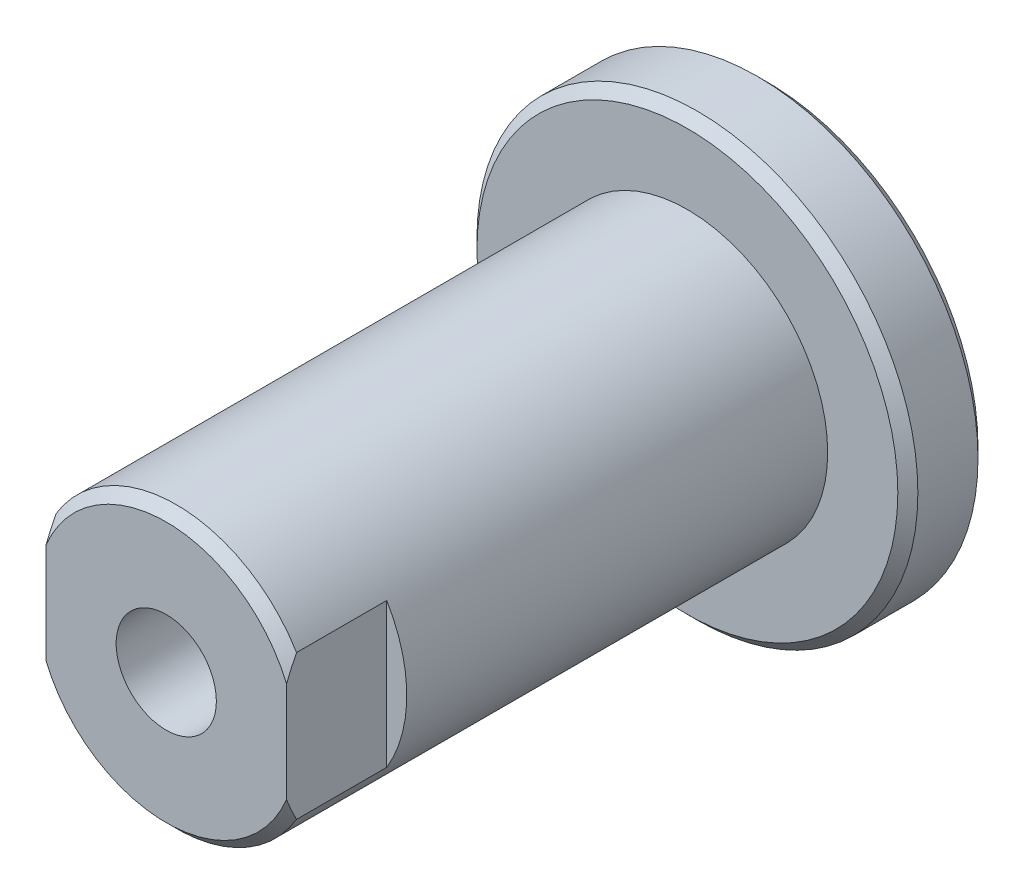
ISO-10303-21;
HEADER;
FILE_DESCRIPTION(('STEP AP214'),'2;1');
FILE_NAME('part.step','',(''),(''),'','','');
FILE_SCHEMA(('AUTOMOTIVE_DESIGN { 1 0 10303 214 1 1 1 1 }'));
ENDSEC;
DATA;
#1=APPLICATION_CONTEXT('core data for automotive mechanical design processes');
#2=APPLICATION_PROTOCOL_DEFINITION('international standard','automotive_design',2000,#1);
#3=PRODUCT_CONTEXT('',#1,'mechanical');
#4=PRODUCT('Part','Part','',(#3));
#5=PRODUCT_RELATED_PRODUCT_CATEGORY('part','',(#4));
#6=PRODUCT_DEFINITION_FORMATION('','',#4);
#7=PRODUCT_DEFINITION_CONTEXT('part definition',#1,'design');
#8=PRODUCT_DEFINITION('design','',#6,#7);
#9=PRODUCT_DEFINITION_SHAPE('','',#8);
#10=(LENGTH_UNIT() NAMED_UNIT(*) SI_UNIT(.MILLI.,.METRE.));
#11=(NAMED_UNIT(*) PLANE_ANGLE_UNIT() SI_UNIT($,.RADIAN.));
#12=(NAMED_UNIT(*) SI_UNIT($,.STERADIAN.) SOLID_ANGLE_UNIT());
#13=UNCERTAINTY_MEASURE_WITH_UNIT(LENGTH_MEASURE(1.E-05),#10,'distance_accuracy_value','');
#14=(GEOMETRIC_REPRESENTATION_CONTEXT(3) GLOBAL_UNCERTAINTY_ASSIGNED_CONTEXT((#13)) GLOBAL_UNIT_ASSIGNED_CONTEXT((#10,
#11,#12)) REPRESENTATION_CONTEXT('',''));
#15=CARTESIAN_POINT('',(0.,0.,0.));
#16=DIRECTION('',(0.,0.,1.));
#17=DIRECTION('',(1.,0.,0.));
#18=AXIS2_PLACEMENT_3D('',#15,#16,#17);
#19=CARTESIAN_POINT('',(0.,0.,30.));
#20=DIRECTION('',(0.,0.,-1.));
#21=DIRECTION('',(-1.,0.,0.));
#22=AXIS2_PLACEMENT_3D('',#19,#20,#21);
#23=CONICAL_SURFACE('',#22,6.5,0.785398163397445);
#24=CARTESIAN_POINT('',(-6.,-14.189120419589,21.0944445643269));
#25=CARTESIAN_POINT('',(-6.,-13.9783762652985,21.2885446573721));
#26=CARTESIAN_POINT('',(-6.,-13.7673091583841,21.4822940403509));
#27=CARTESIAN_POINT('',(-6.,-13.3444339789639,21.8689856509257));
#28=CARTESIAN_POINT('',(-6.,-13.1326259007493,22.0619278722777));
#29=CARTESIAN_POINT('',(-6.,-12.4958585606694,22.6394659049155));
#30=CARTESIAN_POINT('',(-6.,-12.0696493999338,23.0226870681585));
#31=CARTESIAN_POINT('',(-6.,-11.2102831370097,23.7865653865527));
#32=CARTESIAN_POINT('',(-6.,-10.7770995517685,24.1671928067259));
#33=CARTESIAN_POINT('',(-6.,-9.90489563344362,24.9216189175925));
#34=CARTESIAN_POINT('',(-6.,-9.46587600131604,25.2954184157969));
#35=CARTESIAN_POINT('',(-6.,-8.66228186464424,25.9645716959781));
#36=CARTESIAN_POINT('',(-6.,-8.29907851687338,26.2615642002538));
#37=CARTESIAN_POINT('',(-6.,-7.74886070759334,26.700373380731));
#38=CARTESIAN_POINT('',(-6.,-7.56452615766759,26.845549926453));
#39=CARTESIAN_POINT('',(-6.,-7.19377345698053,27.133214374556));
#40=CARTESIAN_POINT('',(-6.,-7.00735535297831,27.2757023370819));
#41=CARTESIAN_POINT('',(-6.,-6.63228473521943,27.5573006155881));
#42=CARTESIAN_POINT('',(-6.,-6.44363475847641,27.6964143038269));
#43=CARTESIAN_POINT('',(-6.,-6.0635049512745,27.9707110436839));
#44=CARTESIAN_POINT('',(-6.,-5.87202526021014,28.1058942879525));
#45=CARTESIAN_POINT('',(-6.,-5.48581052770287,28.3713809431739));
#46=CARTESIAN_POINT('',(-6.,-5.29107678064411,28.5016862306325));
#47=CARTESIAN_POINT('',(-6.,-4.89772697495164,28.756276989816));
#48=CARTESIAN_POINT('',(-6.,-4.69911136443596,28.8805631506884));
#49=CARTESIAN_POINT('',(-6.,-4.29915222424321,29.1204786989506));
#50=CARTESIAN_POINT('',(-6.,-4.09785008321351,29.2361766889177));
#51=CARTESIAN_POINT('',(-6.,-3.69005957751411,29.4581762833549));
#52=CARTESIAN_POINT('',(-6.,-3.48357065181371,29.5644768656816));
#53=CARTESIAN_POINT('',(-6.,-3.06498745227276,29.7649849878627));
#54=CARTESIAN_POINT('',(-6.,-2.8528986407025,29.859203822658));
#55=CARTESIAN_POINT('',(-6.,-2.42254844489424,30.0323888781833));
#56=CARTESIAN_POINT('',(-6.,-2.20428887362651,30.1113595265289));
#57=CARTESIAN_POINT('',(-6.,-1.80920727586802,30.2353361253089));
#58=CARTESIAN_POINT('',(-6.,-1.63353777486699,30.2839940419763));
#59=CARTESIAN_POINT('',(-6.,-1.27894637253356,30.3676229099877));
#60=CARTESIAN_POINT('',(-6.,-1.10002490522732,30.4025956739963));
#61=CARTESIAN_POINT('',(-6.,-0.740353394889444,30.4570998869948));
#62=CARTESIAN_POINT('',(-6.,-0.559610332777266,30.4766767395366));
#63=CARTESIAN_POINT('',(-6.,-0.197085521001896,30.4994890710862));
#64=CARTESIAN_POINT('',(-6.,-0.0153038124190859,30.5027251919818));
#65=CARTESIAN_POINT('',(-6.,0.348026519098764,30.4926630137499));
#66=CARTESIAN_POINT('',(-6.,0.529574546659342,30.4793435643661));
#67=CARTESIAN_POINT('',(-6.,0.890796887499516,30.4368881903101));
#68=CARTESIAN_POINT('',(-6.,1.07047104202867,30.4077509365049));
#69=CARTESIAN_POINT('',(-6.,1.42740071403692,30.3350322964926));
#70=CARTESIAN_POINT('',(-6.,1.60464720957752,30.2914072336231));
#71=CARTESIAN_POINT('',(-6.,1.9555280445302,30.1916103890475));
#72=CARTESIAN_POINT('',(-6.,2.12916232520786,30.1354384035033));
#73=CARTESIAN_POINT('',(-6.,2.50243151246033,30.0017905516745));
#74=CARTESIAN_POINT('',(-6.,2.70134325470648,29.9223089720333));
#75=CARTESIAN_POINT('',(-6.,3.09406710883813,29.7515219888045));
#76=CARTESIAN_POINT('',(-6.,3.28787684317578,29.6602111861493));
#77=CARTESIAN_POINT('',(-6.,3.67106823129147,29.467985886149));
#78=CARTESIAN_POINT('',(-6.,3.86044140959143,29.3670546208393));
#79=CARTESIAN_POINT('',(-6.,4.23490054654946,29.157636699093));
#80=CARTESIAN_POINT('',(-6.,4.41998710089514,29.0491511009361));
#81=CARTESIAN_POINT('',(-6.,4.78863644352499,28.8247540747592));
#82=CARTESIAN_POINT('',(-6.,4.97215428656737,28.7087691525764));
#83=CARTESIAN_POINT('',(-6.,5.33589527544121,28.4717527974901));
#84=CARTESIAN_POINT('',(-6.,5.51611833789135,28.3507212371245));
#85=CARTESIAN_POINT('',(-6.,5.87353199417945,28.1046683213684));
#86=CARTESIAN_POINT('',(-6.,6.05072558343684,27.9796513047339));
#87=CARTESIAN_POINT('',(-6.,6.4026678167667,27.7262165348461));
#88=CARTESIAN_POINT('',(-6.,6.57741636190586,27.5977986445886));
#89=CARTESIAN_POINT('',(-6.,7.0861535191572,27.2175520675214));
#90=CARTESIAN_POINT('',(-6.,7.41727857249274,26.9618924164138));
#91=CARTESIAN_POINT('',(-6.,8.0735777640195,26.4430411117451));
#92=CARTESIAN_POINT('',(-6.,8.39875139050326,26.1798488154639));
#93=CARTESIAN_POINT('',(-6.,9.04470289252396,25.6476667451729));
#94=CARTESIAN_POINT('',(-6.,9.3654774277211,25.3786729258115));
#95=CARTESIAN_POINT('',(-6.,10.0033851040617,24.836401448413));
#96=CARTESIAN_POINT('',(-6.,10.3205181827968,24.5631237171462));
#97=CARTESIAN_POINT('',(-6.,10.9366376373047,24.0264970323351));
#98=CARTESIAN_POINT('',(-6.,11.2357612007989,23.7633053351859));
#99=CARTESIAN_POINT('',(-6.,11.8318528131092,23.2344867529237));
#100=CARTESIAN_POINT('',(-6.,12.1288208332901,22.9688598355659));
#101=CARTESIAN_POINT('',(-6.,12.7205312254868,22.4360265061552));
#102=CARTESIAN_POINT('',(-6.,13.0152762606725,22.1688230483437));
#103=CARTESIAN_POINT('',(-6.,13.6032575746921,21.6327807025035));
#104=CARTESIAN_POINT('',(-6.,13.8964939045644,21.3639418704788));
#105=CARTESIAN_POINT('',(-6.,14.189120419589,21.0944445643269));
#106=B_SPLINE_CURVE_WITH_KNOTS('',3,(#24,#25,#26,#27,#28,#29,#30,#31,#32,#33,#34,#35,#36,#37,
#38,#39,#40,#41,#42,#43,#44,#45,#46,#47,#48,#49,#50,#51,#52,#53,#54,#55,#56,#57,#58,#59,#60,#61,
#62,#63,#64,#65,#66,#67,#68,#69,#70,#71,#72,#73,#74,#75,#76,#77,#78,#79,#80,#81,#82,#83,#84,#85,
#86,#87,#88,#89,#90,#91,#92,#93,#94,#95,#96,#97,#98,#99,#100,#101,#102,#103,#104,#105),
.UNSPECIFIED.,.F.,.F.,(4,2,2,2,2,2,2,2,2,2,2,2,2,2,2,2,2,2,2,2,2,2,2,2,2,2,2,2,2,2,2,2,2,2,2,2,
2,2,2,2,4),(0.,0.8595290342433,1.71906470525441,3.43851653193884,5.16841774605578,
6.89811302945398,8.30550929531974,9.00940677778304,9.71328849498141,10.4164350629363,
11.1195471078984,11.8223858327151,12.5251438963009,13.2214938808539,13.9179195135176,
14.6136892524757,15.3092566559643,15.8556421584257,16.4019552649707,16.9466511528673,
17.4913256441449,18.0366966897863,18.5821135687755,19.129189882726,19.6762750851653,
20.3183990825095,20.960817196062,21.6043762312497,22.2478452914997,22.8990367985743,
23.5502447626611,24.2007664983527,24.8513144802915,26.106152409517,27.3610977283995,
28.6169483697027,29.872820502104,31.0680882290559,32.2633718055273,33.4568688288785,
34.6503252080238),.UNSPECIFIED.);
#107=CARTESIAN_POINT('',(-6.,-3.60555127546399,29.5));
#108=VERTEX_POINT('',#107);
#109=CARTESIAN_POINT('',(-6.,-2.5,30.));
#110=VERTEX_POINT('',#109);
#111=EDGE_CURVE('E51',#108,#110,#106,.T.);
#112=ORIENTED_EDGE('',*,*,#111,.F.);
#113=CARTESIAN_POINT('',(0.,0.,29.5));
#114=DIRECTION('',(0.,0.,1.));
#115=DIRECTION('',(1.,0.,0.));
#116=AXIS2_PLACEMENT_3D('',#113,#114,#115);
#117=CIRCLE('',#116,7.);
#118=CARTESIAN_POINT('',(6.,-3.60555127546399,29.5));
#119=VERTEX_POINT('',#118);
#120=EDGE_CURVE('E120',#119,#108,#117,.F.);
#121=ORIENTED_EDGE('',*,*,#120,.F.);
#122=CARTESIAN_POINT('',(6.,14.189120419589,21.0944445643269));
#123=CARTESIAN_POINT('',(6.,13.9783762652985,21.2885446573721));
#124=CARTESIAN_POINT('',(6.,13.7673091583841,21.4822940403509));
#125=CARTESIAN_POINT('',(6.,13.3444339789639,21.8689856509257));
#126=CARTESIAN_POINT('',(6.,13.1326259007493,22.0619278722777));
#127=CARTESIAN_POINT('',(6.,12.4958585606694,22.6394659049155));
#128=CARTESIAN_POINT('',(6.,12.0696493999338,23.0226870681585));
#129=CARTESIAN_POINT('',(6.,11.2102831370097,23.7865653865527));
#130=CARTESIAN_POINT('',(6.,10.7770995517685,24.1671928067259));
#131=CARTESIAN_POINT('',(6.,9.90489563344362,24.9216189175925));
#132=CARTESIAN_POINT('',(6.,9.46587600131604,25.2954184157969));
#133=CARTESIAN_POINT('',(6.,8.66228186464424,25.9645716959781));
#134=CARTESIAN_POINT('',(6.,8.29907851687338,26.2615642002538));
#135=CARTESIAN_POINT('',(6.,7.74886070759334,26.700373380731));
#136=CARTESIAN_POINT('',(6.,7.56452615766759,26.845549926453));
#137=CARTESIAN_POINT('',(6.,7.19377345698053,27.133214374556));
#138=CARTESIAN_POINT('',(6.,7.00735535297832,27.2757023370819));
#139=CARTESIAN_POINT('',(6.,6.63228473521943,27.5573006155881));
#140=CARTESIAN_POINT('',(6.,6.44363475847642,27.6964143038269));
#141=CARTESIAN_POINT('',(6.,6.06350495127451,27.9707110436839));
#142=CARTESIAN_POINT('',(6.,5.87202526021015,28.1058942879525));
#143=CARTESIAN_POINT('',(6.,5.48581052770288,28.3713809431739));
#144=CARTESIAN_POINT('',(6.,5.29107678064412,28.5016862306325));
#145=CARTESIAN_POINT('',(6.,4.89772697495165,28.756276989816));
#146=CARTESIAN_POINT('',(6.,4.69911136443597,28.8805631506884));
#147=CARTESIAN_POINT('',(6.,4.29915222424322,29.1204786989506));
#148=CARTESIAN_POINT('',(6.,4.09785008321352,29.2361766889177));
#149=CARTESIAN_POINT('',(6.,3.69005957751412,29.4581762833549));
#150=CARTESIAN_POINT('',(6.,3.48357065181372,29.5644768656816));
#151=CARTESIAN_POINT('',(6.,3.06498745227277,29.7649849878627));
#152=CARTESIAN_POINT('',(6.,2.85289864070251,29.859203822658));
#153=CARTESIAN_POINT('',(6.,2.42254844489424,30.0323888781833));
#154=CARTESIAN_POINT('',(6.,2.20428887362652,30.1113595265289));
#155=CARTESIAN_POINT('',(6.,1.80920727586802,30.2353361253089));
#156=CARTESIAN_POINT('',(6.,1.633537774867,30.2839940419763));
#157=CARTESIAN_POINT('',(6.,1.27894637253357,30.3676229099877));
#158=CARTESIAN_POINT('',(6.,1.10002490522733,30.4025956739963));
#159=CARTESIAN_POINT('',(6.,0.740353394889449,30.4570998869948));
#160=CARTESIAN_POINT('',(6.,0.559610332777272,30.4766767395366));
#161=CARTESIAN_POINT('',(6.,0.197085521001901,30.4994890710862));
#162=CARTESIAN_POINT('',(6.,0.0153038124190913,30.5027251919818));
#163=CARTESIAN_POINT('',(6.,-0.348026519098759,30.4926630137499));
#164=CARTESIAN_POINT('',(6.,-0.529574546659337,30.4793435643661));
#165=CARTESIAN_POINT('',(6.,-0.890796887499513,30.4368881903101));
#166=CARTESIAN_POINT('',(6.,-1.07047104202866,30.4077509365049));
#167=CARTESIAN_POINT('',(6.,-1.42740071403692,30.3350322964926));
#168=CARTESIAN_POINT('',(6.,-1.60464720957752,30.2914072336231));
#169=CARTESIAN_POINT('',(6.,-1.95552804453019,30.1916103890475));
#170=CARTESIAN_POINT('',(6.,-2.12916232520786,30.1354384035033));
#171=CARTESIAN_POINT('',(6.,-2.50243151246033,30.0017905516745));
#172=CARTESIAN_POINT('',(6.,-2.70134325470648,29.9223089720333));
#173=CARTESIAN_POINT('',(6.,-3.09406710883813,29.7515219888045));
#174=CARTESIAN_POINT('',(6.,-3.28787684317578,29.6602111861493));
#175=CARTESIAN_POINT('',(6.,-3.67106823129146,29.467985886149));
#176=CARTESIAN_POINT('',(6.,-3.86044140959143,29.3670546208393));
#177=CARTESIAN_POINT('',(6.,-4.23490054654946,29.157636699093));
#178=CARTESIAN_POINT('',(6.,-4.41998710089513,29.0491511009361));
#179=CARTESIAN_POINT('',(6.,-4.78863644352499,28.8247540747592));
#180=CARTESIAN_POINT('',(6.,-4.97215428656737,28.7087691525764));
#181=CARTESIAN_POINT('',(6.,-5.3358952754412,28.4717527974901));
#182=CARTESIAN_POINT('',(6.,-5.51611833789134,28.3507212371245));
#183=CARTESIAN_POINT('',(6.,-5.87353199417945,28.1046683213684));
#184=CARTESIAN_POINT('',(6.,-6.05072558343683,27.9796513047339));
#185=CARTESIAN_POINT('',(6.,-6.40266781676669,27.7262165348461));
#186=CARTESIAN_POINT('',(6.,-6.57741636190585,27.5977986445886));
#187=CARTESIAN_POINT('',(6.,-7.08615351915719,27.2175520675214));
#188=CARTESIAN_POINT('',(6.,-7.41727857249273,26.9618924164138));
#189=CARTESIAN_POINT('',(6.,-8.07357776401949,26.4430411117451));
#190=CARTESIAN_POINT('',(6.,-8.39875139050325,26.1798488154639));
#191=CARTESIAN_POINT('',(6.,-9.04470289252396,25.6476667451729));
#192=CARTESIAN_POINT('',(6.,-9.36547742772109,25.3786729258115));
#193=CARTESIAN_POINT('',(6.,-10.0033851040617,24.836401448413));
#194=CARTESIAN_POINT('',(6.,-10.3205181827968,24.5631237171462));
#195=CARTESIAN_POINT('',(6.,-10.9366376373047,24.0264970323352));
#196=CARTESIAN_POINT('',(6.,-11.2357612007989,23.7633053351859));
#197=CARTESIAN_POINT('',(6.,-11.8318528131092,23.2344867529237));
#198=CARTESIAN_POINT('',(6.,-12.1288208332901,22.9688598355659));
#199=CARTESIAN_POINT('',(6.,-12.7205312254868,22.4360265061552));
#200=CARTESIAN_POINT('',(6.,-13.0152762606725,22.1688230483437));
#201=CARTESIAN_POINT('',(6.,-13.6032575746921,21.6327807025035));
#202=CARTESIAN_POINT('',(6.,-13.8964939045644,21.3639418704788));
#203=CARTESIAN_POINT('',(6.,-14.189120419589,21.0944445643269));
#204=B_SPLINE_CURVE_WITH_KNOTS('',3,(#122,#123,#124,#125,#126,#127,#128,#129,#130,#131,#132,
#133,#134,#135,#136,#137,#138,#139,#140,#141,#142,#143,#144,#145,#146,#147,#148,#149,#150,#151,
#152,#153,#154,#155,#156,#157,#158,#159,#160,#161,#162,#163,#164,#165,#166,#167,#168,#169,#170,
#171,#172,#173,#174,#175,#176,#177,#178,#179,#180,#181,#182,#183,#184,#185,#186,#187,#188,#189,
#190,#191,#192,#193,#194,#195,#196,#197,#198,#199,#200,#201,#202,#203),.UNSPECIFIED.,.F.,.F.,(4,
2,2,2,2,2,2,2,2,2,2,2,2,2,2,2,2,2,2,2,2,2,2,2,2,2,2,2,2,2,2,2,2,2,2,2,2,2,2,2,4),(0.,
0.859529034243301,1.71906470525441,3.43851653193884,5.16841774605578,6.89811302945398,
8.30550929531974,9.00940677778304,9.7132884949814,10.4164350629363,11.1195471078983,
11.822385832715,12.5251438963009,13.2214938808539,13.9179195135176,14.6136892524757,
15.3092566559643,15.8556421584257,16.4019552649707,16.9466511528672,17.4913256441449,
18.0366966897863,18.5821135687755,19.129189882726,19.6762750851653,20.3183990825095,
20.960817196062,21.6043762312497,22.2478452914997,22.8990367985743,23.5502447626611,
24.2007664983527,24.8513144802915,26.106152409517,27.3610977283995,28.6169483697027,
29.872820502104,31.0680882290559,32.2633718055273,33.4568688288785,34.6503252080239),.UNSPECIFIED.);
#205=CARTESIAN_POINT('',(6.,-2.5,30.));
#206=VERTEX_POINT('',#205);
#207=EDGE_CURVE('E111',#206,#119,#204,.T.);
#208=ORIENTED_EDGE('',*,*,#207,.F.);
#209=CARTESIAN_POINT('',(0.,0.,30.));
#210=DIRECTION('',(0.,0.,1.));
#211=DIRECTION('',(1.,0.,0.));
#212=AXIS2_PLACEMENT_3D('',#209,#210,#211);
#213=CIRCLE('',#212,6.5);
#214=EDGE_CURVE('E65',#110,#206,#213,.T.);
#215=ORIENTED_EDGE('',*,*,#214,.F.);
#216=EDGE_LOOP('',(#112,#121,#208,#215));
#217=FACE_BOUND('',#216,.T.);
#218=ADVANCED_FACE('F43',(#217),#23,.T.);
#219=CARTESIAN_POINT('',(0.,0.,4.));
#220=DIRECTION('',(0.,0.,1.));
#221=DIRECTION('',(1.,0.,0.));
#222=AXIS2_PLACEMENT_3D('',#219,#220,#221);
#223=PLANE('',#222);
#224=CARTESIAN_POINT('',(0.,0.,4.));
#225=DIRECTION('',(0.,0.,1.));
#226=DIRECTION('',(1.,0.,0.));
#227=AXIS2_PLACEMENT_3D('',#224,#225,#226);
#228=CIRCLE('',#227,10.5);
#229=CARTESIAN_POINT('',(10.5,0.,4.));
#230=VERTEX_POINT('',#229);
#231=EDGE_CURVE('E112',#230,#230,#228,.T.);
#232=ORIENTED_EDGE('',*,*,#231,.T.);
#233=EDGE_LOOP('',(#232));
#234=FACE_BOUND('',#233,.T.);
#235=CARTESIAN_POINT('',(0.,0.,4.));
#236=DIRECTION('',(0.,0.,1.));
#237=DIRECTION('',(1.,0.,0.));
#238=AXIS2_PLACEMENT_3D('',#235,#236,#237);
#239=CIRCLE('',#238,7.);
#240=CARTESIAN_POINT('',(7.,0.,4.));
#241=VERTEX_POINT('',#240);
#242=EDGE_CURVE('E178',#241,#241,#239,.T.);
#243=ORIENTED_EDGE('',*,*,#242,.F.);
#244=EDGE_LOOP('',(#243));
#245=FACE_BOUND('',#244,.T.);
#246=ADVANCED_FACE('F200',(#234,#245),#223,.T.);
#247=CARTESIAN_POINT('',(0.,0.,4.));
#248=DIRECTION('',(0.,0.,-1.));
#249=DIRECTION('',(-1.,0.,0.));
#250=AXIS2_PLACEMENT_3D('',#247,#248,#249);
#251=CYLINDRICAL_SURFACE('',#250,11.);
#252=CARTESIAN_POINT('',(0.,0.,0.5));
#253=DIRECTION('',(0.,0.,1.));
#254=DIRECTION('',(1.,0.,0.));
#255=AXIS2_PLACEMENT_3D('',#252,#253,#254);
#256=CIRCLE('',#255,11.);
#257=CARTESIAN_POINT('',(11.,0.,0.5));
#258=VERTEX_POINT('',#257);
#259=EDGE_CURVE('E184',#258,#258,#256,.T.);
#260=ORIENTED_EDGE('',*,*,#259,.T.);
#261=EDGE_LOOP('',(#260));
#262=FACE_BOUND('',#261,.T.);
#263=CARTESIAN_POINT('',(0.,0.,3.5));
#264=DIRECTION('',(0.,0.,1.));
#265=DIRECTION('',(1.,0.,0.));
#266=AXIS2_PLACEMENT_3D('',#263,#264,#265);
#267=CIRCLE('',#266,11.);
#268=CARTESIAN_POINT('',(11.,0.,3.5));
#269=VERTEX_POINT('',#268);
#270=EDGE_CURVE('E181',#269,#269,#267,.F.);
#271=ORIENTED_EDGE('',*,*,#270,.T.);
#272=EDGE_LOOP('',(#271));
#273=FACE_BOUND('',#272,.T.);
#274=ADVANCED_FACE('F45',(#262,#273),#251,.T.);
#275=CARTESIAN_POINT('',(0.,0.,0.));
#276=DIRECTION('',(0.,0.,1.));
#277=DIRECTION('',(1.,0.,0.));
#278=AXIS2_PLACEMENT_3D('',#275,#276,#277);
#279=PLANE('',#278);
#280=CARTESIAN_POINT('',(0.,0.,0.));
#281=DIRECTION('',(0.,0.,1.));
#282=DIRECTION('',(1.,0.,0.));
#283=AXIS2_PLACEMENT_3D('',#280,#281,#282);
#284=CIRCLE('',#283,2.49999999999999);
#285=CARTESIAN_POINT('',(2.49999999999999,0.,0.));
#286=VERTEX_POINT('',#285);
#287=EDGE_CURVE('E311',#286,#286,#284,.T.);
#288=ORIENTED_EDGE('',*,*,#287,.T.);
#289=EDGE_LOOP('',(#288));
#290=FACE_BOUND('',#289,.T.);
#291=CARTESIAN_POINT('',(0.,0.,0.));
#292=DIRECTION('',(0.,0.,1.));
#293=DIRECTION('',(1.,0.,0.));
#294=AXIS2_PLACEMENT_3D('',#291,#292,#293);
#295=CIRCLE('',#294,10.5);
#296=CARTESIAN_POINT('',(10.5,0.,0.));
#297=VERTEX_POINT('',#296);
#298=EDGE_CURVE('E116',#297,#297,#295,.F.);
#299=ORIENTED_EDGE('',*,*,#298,.T.);
#300=EDGE_LOOP('',(#299));
#301=FACE_BOUND('',#300,.T.);
#302=ADVANCED_FACE('F189',(#290,#301),#279,.F.);
#303=CARTESIAN_POINT('',(0.,0.,30.));
#304=DIRECTION('',(0.,0.,-1.));
#305=DIRECTION('',(-1.,0.,0.));
#306=AXIS2_PLACEMENT_3D('',#303,#304,#305);
#307=CYLINDRICAL_SURFACE('',#306,7.);
#308=ORIENTED_EDGE('',*,*,#120,.T.);
#309=DIRECTION('',(0.,0.,-1.));
#310=VECTOR('',#309,1.);
#311=CARTESIAN_POINT('',(-6.,-3.60555127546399,30.));
#312=LINE('',#311,#310);
#313=CARTESIAN_POINT('',(-6.,-3.60555127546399,25.));
#314=VERTEX_POINT('',#313);
#315=EDGE_CURVE('E98',#108,#314,#312,.T.);
#316=ORIENTED_EDGE('',*,*,#315,.T.);
#317=CARTESIAN_POINT('',(0.,0.,25.));
#318=DIRECTION('',(0.,0.,-1.));
#319=DIRECTION('',(-1.,0.,0.));
#320=AXIS2_PLACEMENT_3D('',#317,#318,#319);
#321=CIRCLE('',#320,7.);
#322=CARTESIAN_POINT('',(-6.,3.60555127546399,25.));
#323=VERTEX_POINT('',#322);
#324=EDGE_CURVE('E13',#314,#323,#321,.T.);
#325=ORIENTED_EDGE('',*,*,#324,.T.);
#326=DIRECTION('',(0.,0.,-1.));
#327=VECTOR('',#326,1.);
#328=CARTESIAN_POINT('',(-6.,3.60555127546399,30.));
#329=LINE('',#328,#327);
#330=CARTESIAN_POINT('',(-6.,3.60555127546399,29.5));
#331=VERTEX_POINT('',#330);
#332=EDGE_CURVE('E167',#323,#331,#329,.F.);
#333=ORIENTED_EDGE('',*,*,#332,.T.);
#334=CARTESIAN_POINT('',(6.,3.60555127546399,29.5));
#335=VERTEX_POINT('',#334);
#336=EDGE_CURVE('E114',#331,#335,#117,.F.);
#337=ORIENTED_EDGE('',*,*,#336,.T.);
#338=DIRECTION('',(0.,0.,-1.));
#339=VECTOR('',#338,1.);
#340=CARTESIAN_POINT('',(6.,3.60555127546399,30.));
#341=LINE('',#340,#339);
#342=CARTESIAN_POINT('',(6.,3.60555127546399,25.));
#343=VERTEX_POINT('',#342);
#344=EDGE_CURVE('E159',#335,#343,#341,.T.);
#345=ORIENTED_EDGE('',*,*,#344,.T.);
#346=CARTESIAN_POINT('',(0.,0.,25.));
#347=DIRECTION('',(0.,0.,1.));
#348=DIRECTION('',(1.,0.,0.));
#349=AXIS2_PLACEMENT_3D('',#346,#347,#348);
#350=CIRCLE('',#349,7.);
#351=CARTESIAN_POINT('',(6.,-3.60555127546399,25.));
#352=VERTEX_POINT('',#351);
#353=EDGE_CURVE('E129',#352,#343,#350,.T.);
#354=ORIENTED_EDGE('',*,*,#353,.F.);
#355=DIRECTION('',(0.,0.,-1.));
#356=VECTOR('',#355,1.);
#357=CARTESIAN_POINT('',(6.,-3.60555127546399,30.));
#358=LINE('',#357,#356);
#359=EDGE_CURVE('E174',#352,#119,#358,.F.);
#360=ORIENTED_EDGE('',*,*,#359,.T.);
#361=EDGE_LOOP('',(#308,#316,#325,#333,#337,#345,#354,#360));
#362=FACE_BOUND('',#361,.T.);
#363=ORIENTED_EDGE('',*,*,#242,.T.);
#364=EDGE_LOOP('',(#363));
#365=FACE_BOUND('',#364,.T.);
#366=ADVANCED_FACE('F165',(#362,#365),#307,.T.);
#367=CARTESIAN_POINT('',(0.,0.,30.));
#368=DIRECTION('',(0.,0.,1.));
#369=DIRECTION('',(1.,0.,0.));
#370=AXIS2_PLACEMENT_3D('',#367,#368,#369);
#371=PLANE('',#370);
#372=CARTESIAN_POINT('',(0.,0.,30.));
#373=DIRECTION('',(0.,0.,1.));
#374=DIRECTION('',(1.,0.,0.));
#375=AXIS2_PLACEMENT_3D('',#372,#373,#374);
#376=CIRCLE('',#375,2.5);
#377=CARTESIAN_POINT('',(2.5,0.,30.));
#378=VERTEX_POINT('',#377);
#379=EDGE_CURVE('E108',#378,#378,#376,.T.);
#380=ORIENTED_EDGE('',*,*,#379,.F.);
#381=EDGE_LOOP('',(#380));
#382=FACE_BOUND('',#381,.T.);
#383=DIRECTION('',(0.,1.,0.));
#384=VECTOR('',#383,1.);
#385=CARTESIAN_POINT('',(-6.,13.8098106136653,30.));
#386=LINE('',#385,#384);
#387=CARTESIAN_POINT('',(-6.,2.5,30.));
#388=VERTEX_POINT('',#387);
#389=EDGE_CURVE('E58',#110,#388,#386,.T.);
#390=ORIENTED_EDGE('',*,*,#389,.F.);
#391=ORIENTED_EDGE('',*,*,#214,.T.);
#392=DIRECTION('',(0.,-1.,0.));
#393=VECTOR('',#392,1.);
#394=CARTESIAN_POINT('',(6.,11.2333534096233,30.));
#395=LINE('',#394,#393);
#396=CARTESIAN_POINT('',(6.,2.5,30.));
#397=VERTEX_POINT('',#396);
#398=EDGE_CURVE('E157',#397,#206,#395,.T.);
#399=ORIENTED_EDGE('',*,*,#398,.F.);
#400=EDGE_CURVE('E106',#397,#388,#213,.T.);
#401=ORIENTED_EDGE('',*,*,#400,.T.);
#402=EDGE_LOOP('',(#390,#391,#399,#401));
#403=FACE_BOUND('',#402,.T.);
#404=ADVANCED_FACE('F104',(#382,#403),#371,.T.);
#405=CARTESIAN_POINT('',(0.,0.,0.5));
#406=DIRECTION('',(0.,0.,1.));
#407=DIRECTION('',(1.,0.,0.));
#408=AXIS2_PLACEMENT_3D('',#405,#406,#407);
#409=CONICAL_SURFACE('',#408,11.,0.78539816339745);
#410=ORIENTED_EDGE('',*,*,#298,.F.);
#411=EDGE_LOOP('',(#410));
#412=FACE_BOUND('',#411,.T.);
#413=ORIENTED_EDGE('',*,*,#259,.F.);
#414=EDGE_LOOP('',(#413));
#415=FACE_BOUND('',#414,.T.);
#416=ADVANCED_FACE('F191',(#412,#415),#409,.T.);
#417=CARTESIAN_POINT('',(0.,0.,4.));
#418=DIRECTION('',(0.,0.,-1.));
#419=DIRECTION('',(-1.,0.,0.));
#420=AXIS2_PLACEMENT_3D('',#417,#418,#419);
#421=CONICAL_SURFACE('',#420,10.5,0.785398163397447);
#422=ORIENTED_EDGE('',*,*,#270,.F.);
#423=EDGE_LOOP('',(#422));
#424=FACE_BOUND('',#423,.T.);
#425=ORIENTED_EDGE('',*,*,#231,.F.);
#426=EDGE_LOOP('',(#425));
#427=FACE_BOUND('',#426,.T.);
#428=ADVANCED_FACE('F194',(#424,#427),#421,.T.);
#429=EDGE_CURVE('E102',#388,#331,#106,.T.);
#430=ORIENTED_EDGE('',*,*,#429,.F.);
#431=ORIENTED_EDGE('',*,*,#400,.F.);
#432=EDGE_CURVE('E128',#335,#397,#204,.T.);
#433=ORIENTED_EDGE('',*,*,#432,.F.);
#434=ORIENTED_EDGE('',*,*,#336,.F.);
#435=EDGE_LOOP('',(#430,#431,#433,#434));
#436=FACE_BOUND('',#435,.T.);
#437=ADVANCED_FACE('F130',(#436),#23,.T.);
#438=CARTESIAN_POINT('',(6.,-10.6150036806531,25.));
#439=DIRECTION('',(0.,0.,1.));
#440=DIRECTION('',(1.,0.,0.));
#441=AXIS2_PLACEMENT_3D('',#438,#439,#440);
#442=PLANE('',#441);
#443=ORIENTED_EDGE('',*,*,#353,.T.);
#444=DIRECTION('',(0.,-1.,0.));
#445=VECTOR('',#444,1.);
#446=CARTESIAN_POINT('',(6.,11.2333534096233,25.));
#447=LINE('',#446,#445);
#448=EDGE_CURVE('E162',#343,#352,#447,.T.);
#449=ORIENTED_EDGE('',*,*,#448,.T.);
#450=EDGE_LOOP('',(#443,#449));
#451=FACE_BOUND('',#450,.T.);
#452=ADVANCED_FACE('F138',(#451),#442,.T.);
#453=CARTESIAN_POINT('',(6.,11.2333534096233,25.));
#454=DIRECTION('',(-1.,0.,0.));
#455=DIRECTION('',(0.,-1.,0.));
#456=AXIS2_PLACEMENT_3D('',#453,#454,#455);
#457=PLANE('',#456);
#458=ORIENTED_EDGE('',*,*,#432,.T.);
#459=ORIENTED_EDGE('',*,*,#398,.T.);
#460=ORIENTED_EDGE('',*,*,#207,.T.);
#461=ORIENTED_EDGE('',*,*,#359,.F.);
#462=ORIENTED_EDGE('',*,*,#448,.F.);
#463=ORIENTED_EDGE('',*,*,#344,.F.);
#464=EDGE_LOOP('',(#458,#459,#460,#461,#462,#463));
#465=FACE_BOUND('',#464,.T.);
#466=ADVANCED_FACE('F133',(#465),#457,.F.);
#467=CARTESIAN_POINT('',(-6.,-10.6150036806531,25.));
#468=DIRECTION('',(0.,0.,-1.));
#469=DIRECTION('',(-1.,0.,0.));
#470=AXIS2_PLACEMENT_3D('',#467,#468,#469);
#471=PLANE('',#470);
#472=DIRECTION('',(0.,1.,0.));
#473=VECTOR('',#472,1.);
#474=CARTESIAN_POINT('',(-6.,13.8098106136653,25.));
#475=LINE('',#474,#473);
#476=EDGE_CURVE('E107',#314,#323,#475,.T.);
#477=ORIENTED_EDGE('',*,*,#476,.T.);
#478=ORIENTED_EDGE('',*,*,#324,.F.);
#479=EDGE_LOOP('',(#477,#478));
#480=FACE_BOUND('',#479,.T.);
#481=ADVANCED_FACE('F137',(#480),#471,.F.);
#482=CARTESIAN_POINT('',(-6.,13.8098106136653,25.));
#483=DIRECTION('',(1.,0.,0.));
#484=DIRECTION('',(0.,1.,0.));
#485=AXIS2_PLACEMENT_3D('',#482,#483,#484);
#486=PLANE('',#485);
#487=ORIENTED_EDGE('',*,*,#111,.T.);
#488=ORIENTED_EDGE('',*,*,#389,.T.);
#489=ORIENTED_EDGE('',*,*,#429,.T.);
#490=ORIENTED_EDGE('',*,*,#332,.F.);
#491=ORIENTED_EDGE('',*,*,#476,.F.);
#492=ORIENTED_EDGE('',*,*,#315,.F.);
#493=EDGE_LOOP('',(#487,#488,#489,#490,#491,#492));
#494=FACE_BOUND('',#493,.T.);
#495=ADVANCED_FACE('F95',(#494),#486,.F.);
#496=CARTESIAN_POINT('',(0.,0.,30.));
#497=DIRECTION('',(0.,0.,1.));
#498=DIRECTION('',(1.,0.,0.));
#499=AXIS2_PLACEMENT_3D('',#496,#497,#498);
#500=CYLINDRICAL_SURFACE('',#499,2.5);
#501=ORIENTED_EDGE('',*,*,#287,.F.);
#502=EDGE_LOOP('',(#501));
#503=FACE_BOUND('',#502,.T.);
#504=ORIENTED_EDGE('',*,*,#379,.T.);
#505=EDGE_LOOP('',(#504));
#506=FACE_BOUND('',#505,.T.);
#507=ADVANCED_FACE('F146',(#503,#506),#500,.F.);
#508=CLOSED_SHELL('',(#218,#246,#274,#302,#366,#404,#416,#428,#437,#452,#466,#481,#495,#507));
#509=MANIFOLD_SOLID_BREP('B2',#508);
#510=ADVANCED_BREP_SHAPE_REPRESENTATION('',(#18,#509),#14);
#511=SHAPE_DEFINITION_REPRESENTATION(#9,#510);
ENDSEC;
END-ISO-10303-21;
